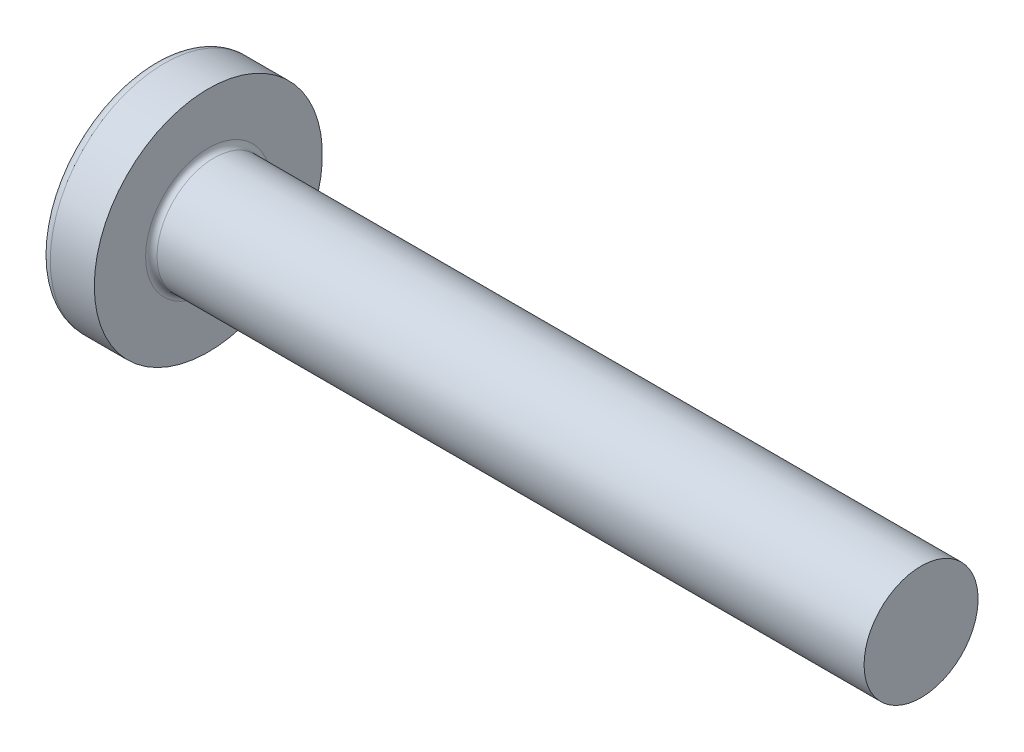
ISO-10303-21;
HEADER;
FILE_DESCRIPTION(('STEP AP214'),'2;1');
FILE_NAME('part.step','',(''),(''),'','','');
FILE_SCHEMA(('AUTOMOTIVE_DESIGN { 1 0 10303 214 1 1 1 1 }'));
ENDSEC;
DATA;
#1=APPLICATION_CONTEXT('core data for automotive mechanical design processes');
#2=APPLICATION_PROTOCOL_DEFINITION('international standard','automotive_design',2000,#1);
#3=PRODUCT_CONTEXT('',#1,'mechanical');
#4=PRODUCT('Part','Part','',(#3));
#5=PRODUCT_RELATED_PRODUCT_CATEGORY('part','',(#4));
#6=PRODUCT_DEFINITION_FORMATION('','',#4);
#7=PRODUCT_DEFINITION_CONTEXT('part definition',#1,'design');
#8=PRODUCT_DEFINITION('design','',#6,#7);
#9=PRODUCT_DEFINITION_SHAPE('','',#8);
#10=(LENGTH_UNIT() NAMED_UNIT(*) SI_UNIT(.MILLI.,.METRE.));
#11=(NAMED_UNIT(*) PLANE_ANGLE_UNIT() SI_UNIT($,.RADIAN.));
#12=(NAMED_UNIT(*) SI_UNIT($,.STERADIAN.) SOLID_ANGLE_UNIT());
#13=UNCERTAINTY_MEASURE_WITH_UNIT(LENGTH_MEASURE(1.E-05),#10,'distance_accuracy_value','');
#14=(GEOMETRIC_REPRESENTATION_CONTEXT(3) GLOBAL_UNCERTAINTY_ASSIGNED_CONTEXT((#13)) GLOBAL_UNIT_ASSIGNED_CONTEXT((#10,
#11,#12)) REPRESENTATION_CONTEXT('',''));
#15=CARTESIAN_POINT('',(0.,0.,0.));
#16=DIRECTION('',(0.,0.,1.));
#17=DIRECTION('',(1.,0.,0.));
#18=AXIS2_PLACEMENT_3D('',#15,#16,#17);
#19=CARTESIAN_POINT('',(6.5,0.,0.));
#20=DIRECTION('',(-1.,0.,0.));
#21=DIRECTION('',(0.,1.,0.));
#22=AXIS2_PLACEMENT_3D('',#19,#20,#21);
#23=SPHERICAL_SURFACE('',#22,6.5);
#24=CARTESIAN_POINT('',(1.26538895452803,0.,0.));
#25=DIRECTION('',(-1.,0.,0.));
#26=DIRECTION('',(0.,0.,1.));
#27=AXIS2_PLACEMENT_3D('',#24,#25,#26);
#28=CIRCLE('',#27,3.85342019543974);
#29=CARTESIAN_POINT('',(1.26538895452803,0.,3.85342019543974));
#30=VERTEX_POINT('',#29);
#31=EDGE_CURVE('E210',#30,#30,#28,.T.);
#32=ORIENTED_EDGE('',*,*,#31,.T.);
#33=EDGE_LOOP('',(#32));
#34=FACE_BOUND('',#33,.T.);
#35=CARTESIAN_POINT('',(0.0788099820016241,0.,0.));
#36=DIRECTION('',(1.,0.,0.));
#37=DIRECTION('',(0.,0.,-1.));
#38=AXIS2_PLACEMENT_3D('',#35,#36,#37);
#39=CIRCLE('',#38,1.0091178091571);
#40=CARTESIAN_POINT('',(0.0788099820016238,-0.514999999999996,-0.867809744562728));
#41=VERTEX_POINT('',#40);
#42=CARTESIAN_POINT('',(0.0788099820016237,-0.867809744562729,-0.515));
#43=VERTEX_POINT('',#42);
#44=EDGE_CURVE('E398',#41,#43,#39,.F.);
#45=ORIENTED_EDGE('',*,*,#44,.F.);
#46=CARTESIAN_POINT('',(6.5,-0.515,0.));
#47=DIRECTION('',(0.,1.,0.));
#48=DIRECTION('',(0.,0.,1.));
#49=AXIS2_PLACEMENT_3D('',#46,#47,#48);
#50=CIRCLE('',#49,6.47956595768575);
#51=CARTESIAN_POINT('',(0.331830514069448,-0.514999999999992,-1.98455541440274));
#52=VERTEX_POINT('',#51);
#53=EDGE_CURVE('E255',#52,#41,#50,.T.);
#54=ORIENTED_EDGE('',*,*,#53,.F.);
#55=CARTESIAN_POINT('',(6.06443205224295,0.,0.873614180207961));
#56=DIRECTION('',(0.446197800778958,0.,-0.89493436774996));
#57=DIRECTION('',(-0.89493436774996,0.,-0.446197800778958));
#58=AXIS2_PLACEMENT_3D('',#55,#56,#57);
#59=CIRCLE('',#58,6.4262803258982);
#60=CARTESIAN_POINT('',(0.331830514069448,0.515000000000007,-1.98455541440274));
#61=VERTEX_POINT('',#60);
#62=EDGE_CURVE('E229',#52,#61,#59,.T.);
#63=ORIENTED_EDGE('',*,*,#62,.T.);
#64=CARTESIAN_POINT('',(6.5,0.515,0.));
#65=DIRECTION('',(0.,-1.,0.));
#66=DIRECTION('',(0.,0.,-1.));
#67=AXIS2_PLACEMENT_3D('',#64,#65,#66);
#68=CIRCLE('',#67,6.47956595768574);
#69=CARTESIAN_POINT('',(0.0788099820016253,0.515000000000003,-0.867809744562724));
#70=VERTEX_POINT('',#69);
#71=EDGE_CURVE('E263',#70,#61,#68,.T.);
#72=ORIENTED_EDGE('',*,*,#71,.F.);
#73=CARTESIAN_POINT('',(0.0788099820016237,0.867809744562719,-0.515));
#74=VERTEX_POINT('',#73);
#75=EDGE_CURVE('E330',#74,#70,#39,.F.);
#76=ORIENTED_EDGE('',*,*,#75,.F.);
#77=CARTESIAN_POINT('',(6.5,0.,-0.515));
#78=DIRECTION('',(0.,0.,1.));
#79=DIRECTION('',(1.,0.,0.));
#80=AXIS2_PLACEMENT_3D('',#77,#78,#79);
#81=CIRCLE('',#80,6.47956595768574);
#82=CARTESIAN_POINT('',(0.331830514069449,1.98455541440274,-0.515));
#83=VERTEX_POINT('',#82);
#84=EDGE_CURVE('E223',#83,#74,#81,.T.);
#85=ORIENTED_EDGE('',*,*,#84,.F.);
#86=CARTESIAN_POINT('',(6.06443205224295,-0.873614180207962,0.));
#87=DIRECTION('',(0.446197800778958,0.89493436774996,0.));
#88=DIRECTION('',(-0.89493436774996,0.446197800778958,0.));
#89=AXIS2_PLACEMENT_3D('',#86,#87,#88);
#90=CIRCLE('',#89,6.4262803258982);
#91=CARTESIAN_POINT('',(0.331830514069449,1.98455541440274,0.514999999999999));
#92=VERTEX_POINT('',#91);
#93=EDGE_CURVE('E226',#83,#92,#90,.T.);
#94=ORIENTED_EDGE('',*,*,#93,.T.);
#95=CARTESIAN_POINT('',(6.5,0.,0.515));
#96=DIRECTION('',(0.,0.,-1.));
#97=DIRECTION('',(0.,1.,0.));
#98=AXIS2_PLACEMENT_3D('',#95,#96,#97);
#99=CIRCLE('',#98,6.47956595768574);
#100=CARTESIAN_POINT('',(0.0788099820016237,0.867809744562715,0.514999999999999));
#101=VERTEX_POINT('',#100);
#102=EDGE_CURVE('E219',#101,#92,#99,.T.);
#103=ORIENTED_EDGE('',*,*,#102,.F.);
#104=CARTESIAN_POINT('',(0.0788099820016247,0.514999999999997,0.867809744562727));
#105=VERTEX_POINT('',#104);
#106=EDGE_CURVE('E360',#105,#101,#39,.F.);
#107=ORIENTED_EDGE('',*,*,#106,.F.);
#108=CARTESIAN_POINT('',(0.331830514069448,0.514999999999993,1.98455541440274));
#109=VERTEX_POINT('',#108);
#110=EDGE_CURVE('E239',#109,#105,#68,.T.);
#111=ORIENTED_EDGE('',*,*,#110,.F.);
#112=CARTESIAN_POINT('',(6.06443205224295,0.,-0.873614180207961));
#113=DIRECTION('',(0.446197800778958,0.,0.89493436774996));
#114=DIRECTION('',(0.89493436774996,0.,-0.446197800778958));
#115=AXIS2_PLACEMENT_3D('',#112,#113,#114);
#116=CIRCLE('',#115,6.4262803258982);
#117=CARTESIAN_POINT('',(0.331830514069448,-0.515000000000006,1.98455541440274));
#118=VERTEX_POINT('',#117);
#119=EDGE_CURVE('E44',#109,#118,#116,.T.);
#120=ORIENTED_EDGE('',*,*,#119,.T.);
#121=CARTESIAN_POINT('',(0.0788099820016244,-0.515000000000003,0.867809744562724));
#122=VERTEX_POINT('',#121);
#123=EDGE_CURVE('E236',#122,#118,#50,.T.);
#124=ORIENTED_EDGE('',*,*,#123,.F.);
#125=CARTESIAN_POINT('',(0.0788099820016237,-0.867809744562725,0.514999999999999));
#126=VERTEX_POINT('',#125);
#127=EDGE_CURVE('E394',#126,#122,#39,.F.);
#128=ORIENTED_EDGE('',*,*,#127,.F.);
#129=CARTESIAN_POINT('',(0.331830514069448,-1.98455541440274,0.514999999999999));
#130=VERTEX_POINT('',#129);
#131=EDGE_CURVE('E220',#130,#126,#99,.T.);
#132=ORIENTED_EDGE('',*,*,#131,.F.);
#133=CARTESIAN_POINT('',(6.06443205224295,0.87361418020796,0.));
#134=DIRECTION('',(0.446197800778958,-0.89493436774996,0.));
#135=DIRECTION('',(0.89493436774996,0.446197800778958,0.));
#136=AXIS2_PLACEMENT_3D('',#133,#134,#135);
#137=CIRCLE('',#136,6.4262803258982);
#138=CARTESIAN_POINT('',(0.331830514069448,-1.98455541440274,-0.515));
#139=VERTEX_POINT('',#138);
#140=EDGE_CURVE('E216',#130,#139,#137,.T.);
#141=ORIENTED_EDGE('',*,*,#140,.T.);
#142=EDGE_CURVE('E59',#43,#139,#81,.T.);
#143=ORIENTED_EDGE('',*,*,#142,.F.);
#144=EDGE_LOOP('',(#45,#54,#63,#72,#76,#85,#94,#103,#107,#111,#120,#124,#128,#132,#141,#143));
#145=FACE_BOUND('',#144,.T.);
#146=ADVANCED_FACE('F31',(#34,#145),#23,.T.);
#147=CARTESIAN_POINT('',(0.,2.15,-0.515));
#148=DIRECTION('',(0.,0.,1.));
#149=DIRECTION('',(1.,0.,0.));
#150=AXIS2_PLACEMENT_3D('',#147,#148,#149);
#151=PLANE('',#150);
#152=ORIENTED_EDGE('',*,*,#84,.T.);
#153=CARTESIAN_POINT('',(-1.51195208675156,0.994972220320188,-0.515));
#154=CARTESIAN_POINT('',(-1.20405981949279,0.970722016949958,-0.515));
#155=CARTESIAN_POINT('',(-0.896180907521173,0.946299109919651,-0.515));
#156=CARTESIAN_POINT('',(-0.280449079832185,0.896981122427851,-0.515));
#157=CARTESIAN_POINT('',(0.0274038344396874,0.872086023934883,-0.515));
#158=CARTESIAN_POINT('',(0.489146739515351,0.83429553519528,-0.515));
#159=CARTESIAN_POINT('',(0.643055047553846,0.821624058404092,-0.515));
#160=CARTESIAN_POINT('',(0.950856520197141,0.796108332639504,-0.515));
#161=CARTESIAN_POINT('',(1.10474968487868,0.783264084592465,-0.515));
#162=CARTESIAN_POINT('',(1.41251352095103,0.757376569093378,-0.515));
#163=CARTESIAN_POINT('',(1.56638419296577,0.744333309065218,-0.515));
#164=CARTESIAN_POINT('',(1.87410847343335,0.718013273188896,-0.515));
#165=CARTESIAN_POINT('',(2.02796208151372,0.704736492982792,-0.515));
#166=CARTESIAN_POINT('',(2.36455311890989,0.675386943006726,-0.515));
#167=CARTESIAN_POINT('',(2.54728562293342,0.659257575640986,-0.515));
#168=CARTESIAN_POINT('',(2.91270624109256,0.626517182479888,-0.515));
#169=CARTESIAN_POINT('',(3.09539435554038,0.609906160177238,-0.515));
#170=CARTESIAN_POINT('',(3.46069832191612,0.576073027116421,-0.515));
#171=CARTESIAN_POINT('',(3.64331417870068,0.558850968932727,-0.515));
#172=CARTESIAN_POINT('',(4.00847437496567,0.523604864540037,-0.515));
#173=CARTESIAN_POINT('',(4.19101871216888,0.505580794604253,-0.515));
#174=CARTESIAN_POINT('',(4.55606208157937,0.468429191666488,-0.515));
#175=CARTESIAN_POINT('',(4.73856107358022,0.449301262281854,-0.515));
#176=CARTESIAN_POINT('',(5.10337547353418,0.409473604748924,-0.515));
#177=CARTESIAN_POINT('',(5.28569089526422,0.38877400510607,-0.515));
#178=CARTESIAN_POINT('',(5.55897278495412,0.355828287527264,-0.515));
#179=CARTESIAN_POINT('',(5.65005277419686,0.344527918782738,-0.515));
#180=CARTESIAN_POINT('',(5.83209904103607,0.321075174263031,-0.515));
#181=CARTESIAN_POINT('',(5.92306532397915,0.308922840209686,-0.515));
#182=CARTESIAN_POINT('',(6.10486078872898,0.28342733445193,-0.515));
#183=CARTESIAN_POINT('',(6.1956899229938,0.270083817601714,-0.515));
#184=CARTESIAN_POINT('',(6.33172773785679,0.248701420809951,-0.515));
#185=CARTESIAN_POINT('',(6.37704304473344,0.241345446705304,-0.515));
#186=CARTESIAN_POINT('',(6.4675722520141,0.226018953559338,-0.515));
#187=CARTESIAN_POINT('',(6.51278614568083,0.218048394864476,-0.515));
#188=CARTESIAN_POINT('',(6.55793125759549,0.209691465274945,-0.515));
#189=B_SPLINE_CURVE_WITH_KNOTS('',3,(#153,#154,#155,#156,#157,#158,#159,#160,#161,#162,#163,
#164,#165,#166,#167,#168,#169,#170,#171,#172,#173,#174,#175,#176,#177,#178,#179,#180,#181,#182,
#183,#184,#185,#186,#187,#188),.UNSPECIFIED.,.F.,.F.,(4,2,2,2,2,2,2,2,2,2,2,2,2,2,2,2,2,4),(0.,
0.926537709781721,1.85311087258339,2.31639796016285,2.77968256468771,3.24294992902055,
3.70622594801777,4.25655436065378,4.80687878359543,5.35715597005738,5.90744944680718,
6.45794177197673,7.008389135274,7.28372117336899,7.55903973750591,7.83443833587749,
7.97216007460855,8.10989070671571),.UNSPECIFIED.);
#190=CARTESIAN_POINT('',(2.34,0.677477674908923,-0.515));
#191=VERTEX_POINT('',#190);
#192=EDGE_CURVE('E323',#74,#191,#189,.T.);
#193=ORIENTED_EDGE('',*,*,#192,.T.);
#194=DIRECTION('',(0.,1.,0.));
#195=VECTOR('',#194,1.);
#196=CARTESIAN_POINT('',(2.34,-0.983319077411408,-0.515));
#197=LINE('',#196,#195);
#198=CARTESIAN_POINT('',(2.34,0.983319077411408,-0.515));
#199=VERTEX_POINT('',#198);
#200=EDGE_CURVE('E278',#191,#199,#197,.T.);
#201=ORIENTED_EDGE('',*,*,#200,.T.);
#202=DIRECTION('',(0.89493436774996,-0.446197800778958,0.));
#203=VECTOR('',#202,1.);
#204=CARTESIAN_POINT('',(0.,2.15,-0.515));
#205=LINE('',#204,#203);
#206=EDGE_CURVE('E284',#83,#199,#205,.T.);
#207=ORIENTED_EDGE('',*,*,#206,.F.);
#208=EDGE_LOOP('',(#152,#193,#201,#207));
#209=FACE_BOUND('',#208,.T.);
#210=ADVANCED_FACE('F165',(#209),#151,.T.);
#211=CARTESIAN_POINT('',(2.34,-0.983319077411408,-0.515));
#212=VERTEX_POINT('',#211);
#213=CARTESIAN_POINT('',(2.34,-0.677477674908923,-0.515));
#214=VERTEX_POINT('',#213);
#215=EDGE_CURVE('E275',#212,#214,#197,.T.);
#216=ORIENTED_EDGE('',*,*,#215,.T.);
#217=CARTESIAN_POINT('',(-1.51195208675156,-0.994972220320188,-0.515));
#218=CARTESIAN_POINT('',(-1.20405981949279,-0.970722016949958,-0.515));
#219=CARTESIAN_POINT('',(-0.896180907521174,-0.946299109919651,-0.515));
#220=CARTESIAN_POINT('',(-0.280449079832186,-0.896981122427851,-0.515));
#221=CARTESIAN_POINT('',(0.0274038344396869,-0.872086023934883,-0.515));
#222=CARTESIAN_POINT('',(0.48914673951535,-0.83429553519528,-0.515));
#223=CARTESIAN_POINT('',(0.643055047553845,-0.821624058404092,-0.515));
#224=CARTESIAN_POINT('',(0.95085652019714,-0.796108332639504,-0.515));
#225=CARTESIAN_POINT('',(1.10474968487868,-0.783264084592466,-0.515));
#226=CARTESIAN_POINT('',(1.41251352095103,-0.757376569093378,-0.515));
#227=CARTESIAN_POINT('',(1.56638419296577,-0.744333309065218,-0.515));
#228=CARTESIAN_POINT('',(1.87410847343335,-0.718013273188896,-0.515));
#229=CARTESIAN_POINT('',(2.02796208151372,-0.704736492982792,-0.515));
#230=CARTESIAN_POINT('',(2.36455311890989,-0.675386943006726,-0.515));
#231=CARTESIAN_POINT('',(2.54728562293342,-0.659257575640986,-0.515));
#232=CARTESIAN_POINT('',(2.91270624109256,-0.626517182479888,-0.515));
#233=CARTESIAN_POINT('',(3.09539435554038,-0.609906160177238,-0.515));
#234=CARTESIAN_POINT('',(3.46069832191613,-0.576073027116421,-0.515));
#235=CARTESIAN_POINT('',(3.64331417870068,-0.558850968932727,-0.515));
#236=CARTESIAN_POINT('',(4.00847437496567,-0.523604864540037,-0.515));
#237=CARTESIAN_POINT('',(4.19101871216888,-0.505580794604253,-0.515));
#238=CARTESIAN_POINT('',(4.55606208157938,-0.468429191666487,-0.515));
#239=CARTESIAN_POINT('',(4.73856107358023,-0.449301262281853,-0.515));
#240=CARTESIAN_POINT('',(5.10337547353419,-0.409473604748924,-0.515));
#241=CARTESIAN_POINT('',(5.28569089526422,-0.388774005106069,-0.515));
#242=CARTESIAN_POINT('',(5.55897278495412,-0.355828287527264,-0.515));
#243=CARTESIAN_POINT('',(5.65005277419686,-0.344527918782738,-0.515));
#244=CARTESIAN_POINT('',(5.83209904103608,-0.321075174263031,-0.515));
#245=CARTESIAN_POINT('',(5.92306532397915,-0.308922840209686,-0.515));
#246=CARTESIAN_POINT('',(6.10486078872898,-0.28342733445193,-0.515));
#247=CARTESIAN_POINT('',(6.1956899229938,-0.270083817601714,-0.515));
#248=CARTESIAN_POINT('',(6.33172773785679,-0.248701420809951,-0.515));
#249=CARTESIAN_POINT('',(6.37704304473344,-0.241345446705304,-0.515));
#250=CARTESIAN_POINT('',(6.4675722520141,-0.226018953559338,-0.515));
#251=CARTESIAN_POINT('',(6.51278614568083,-0.218048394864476,-0.515));
#252=CARTESIAN_POINT('',(6.55793125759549,-0.209691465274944,-0.515));
#253=B_SPLINE_CURVE_WITH_KNOTS('',3,(#217,#218,#219,#220,#221,#222,#223,#224,#225,#226,#227,
#228,#229,#230,#231,#232,#233,#234,#235,#236,#237,#238,#239,#240,#241,#242,#243,#244,#245,#246,
#247,#248,#249,#250,#251,#252),.UNSPECIFIED.,.F.,.F.,(4,2,2,2,2,2,2,2,2,2,2,2,2,2,2,2,2,4),(0.,
0.926537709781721,1.85311087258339,2.31639796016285,2.77968256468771,3.24294992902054,
3.70622594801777,4.25655436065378,4.80687878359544,5.35715597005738,5.90744944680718,
6.45794177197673,7.008389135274,7.28372117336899,7.55903973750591,7.83443833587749,
7.97216007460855,8.10989070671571),.UNSPECIFIED.);
#254=EDGE_CURVE('E316',#214,#43,#253,.F.);
#255=ORIENTED_EDGE('',*,*,#254,.T.);
#256=ORIENTED_EDGE('',*,*,#142,.T.);
#257=DIRECTION('',(0.89493436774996,0.446197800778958,0.));
#258=VECTOR('',#257,1.);
#259=CARTESIAN_POINT('',(0.,-2.15,-0.515));
#260=LINE('',#259,#258);
#261=EDGE_CURVE('E281',#139,#212,#260,.T.);
#262=ORIENTED_EDGE('',*,*,#261,.T.);
#263=EDGE_LOOP('',(#216,#255,#256,#262));
#264=FACE_BOUND('',#263,.T.);
#265=ADVANCED_FACE('F172',(#264),#151,.T.);
#266=CARTESIAN_POINT('',(0.,-2.15,0.514999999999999));
#267=DIRECTION('',(0.,0.,-1.));
#268=DIRECTION('',(0.,1.,0.));
#269=AXIS2_PLACEMENT_3D('',#266,#267,#268);
#270=PLANE('',#269);
#271=DIRECTION('',(0.,-1.,0.));
#272=VECTOR('',#271,1.);
#273=CARTESIAN_POINT('',(2.34,0.983319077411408,0.515));
#274=LINE('',#273,#272);
#275=CARTESIAN_POINT('',(2.34,0.983319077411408,0.515));
#276=VERTEX_POINT('',#275);
#277=CARTESIAN_POINT('',(2.34,0.677477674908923,0.515));
#278=VERTEX_POINT('',#277);
#279=EDGE_CURVE('E268',#276,#278,#274,.T.);
#280=ORIENTED_EDGE('',*,*,#279,.T.);
#281=CARTESIAN_POINT('',(-1.51195208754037,0.994972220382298,0.514999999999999));
#282=CARTESIAN_POINT('',(-1.20405982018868,0.970722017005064,0.514999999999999));
#283=CARTESIAN_POINT('',(-0.896180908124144,0.946299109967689,0.514999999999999));
#284=CARTESIAN_POINT('',(-0.280449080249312,0.896981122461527,0.515));
#285=CARTESIAN_POINT('',(0.0274038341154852,0.872086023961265,0.515));
#286=CARTESIAN_POINT('',(0.489146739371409,0.834295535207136,0.515));
#287=CARTESIAN_POINT('',(0.643055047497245,0.821624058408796,0.515));
#288=CARTESIAN_POINT('',(0.950856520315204,0.796108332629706,0.515));
#289=CARTESIAN_POINT('',(1.10474968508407,0.783264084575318,0.515));
#290=CARTESIAN_POINT('',(1.41251352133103,0.757376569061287,0.515));
#291=CARTESIAN_POINT('',(1.56638419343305,0.744333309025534,0.515));
#292=CARTESIAN_POINT('',(1.87410847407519,0.718013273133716,0.515));
#293=CARTESIAN_POINT('',(2.02796208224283,0.70473649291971,0.515));
#294=CARTESIAN_POINT('',(2.36455311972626,0.675386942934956,0.515));
#295=CARTESIAN_POINT('',(2.5472856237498,0.659257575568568,0.515));
#296=CARTESIAN_POINT('',(2.91270624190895,0.626517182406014,0.515));
#297=CARTESIAN_POINT('',(3.09539435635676,0.609906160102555,0.515));
#298=CARTESIAN_POINT('',(3.46069832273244,0.576073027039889,0.515));
#299=CARTESIAN_POINT('',(3.64331417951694,0.558850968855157,0.515));
#300=CARTESIAN_POINT('',(4.00847437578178,0.523604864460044,0.515));
#301=CARTESIAN_POINT('',(4.1910187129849,0.505580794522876,0.515));
#302=CARTESIAN_POINT('',(4.55606208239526,0.46842919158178,0.515));
#303=CARTESIAN_POINT('',(4.73856107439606,0.449301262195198,0.515));
#304=CARTESIAN_POINT('',(5.10337547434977,0.409473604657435,0.515));
#305=CARTESIAN_POINT('',(5.28569089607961,0.388774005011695,0.515));
#306=CARTESIAN_POINT('',(5.55897278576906,0.355828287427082,0.515));
#307=CARTESIAN_POINT('',(5.65005277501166,0.344527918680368,0.515));
#308=CARTESIAN_POINT('',(5.83209904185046,0.321075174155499,0.515));
#309=CARTESIAN_POINT('',(5.92306532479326,0.30892284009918,0.515));
#310=CARTESIAN_POINT('',(6.10486078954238,0.283427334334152,0.515));
#311=CARTESIAN_POINT('',(6.19568992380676,0.270083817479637,0.515));
#312=CARTESIAN_POINT('',(6.33172773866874,0.248701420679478,0.515));
#313=CARTESIAN_POINT('',(6.377043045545,0.241345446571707,0.515));
#314=CARTESIAN_POINT('',(6.46757225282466,0.226018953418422,0.515));
#315=CARTESIAN_POINT('',(6.51278614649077,0.218048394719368,0.515));
#316=CARTESIAN_POINT('',(6.55793125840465,0.209691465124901,0.515));
#317=B_SPLINE_CURVE_WITH_KNOTS('',3,(#281,#282,#283,#284,#285,#286,#287,#288,#289,#290,#291,
#292,#293,#294,#295,#296,#297,#298,#299,#300,#301,#302,#303,#304,#305,#306,#307,#308,#309,#310,
#311,#312,#313,#314,#315,#316),.UNSPECIFIED.,.F.,.F.,(4,2,2,2,2,2,2,2,2,2,2,2,2,2,2,2,2,4),(0.,
0.926537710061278,1.85311087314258,2.31639796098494,2.77968256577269,3.24294993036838,
3.70622594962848,4.25655436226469,4.80687878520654,5.3571559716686,5.90744944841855,
6.45794177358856,7.00838913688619,7.28372117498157,7.55903973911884,7.83443833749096,
7.97216007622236,8.10989070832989),.UNSPECIFIED.);
#318=EDGE_CURVE('E361',#278,#101,#317,.F.);
#319=ORIENTED_EDGE('',*,*,#318,.T.);
#320=ORIENTED_EDGE('',*,*,#102,.T.);
#321=DIRECTION('',(0.89493436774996,-0.446197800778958,0.));
#322=VECTOR('',#321,1.);
#323=CARTESIAN_POINT('',(0.,2.15,0.515));
#324=LINE('',#323,#322);
#325=EDGE_CURVE('E283',#92,#276,#324,.T.);
#326=ORIENTED_EDGE('',*,*,#325,.T.);
#327=EDGE_LOOP('',(#280,#319,#320,#326));
#328=FACE_BOUND('',#327,.T.);
#329=ADVANCED_FACE('F311',(#328),#270,.T.);
#330=ORIENTED_EDGE('',*,*,#131,.T.);
#331=CARTESIAN_POINT('',(-1.51195208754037,-0.994972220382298,0.514999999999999));
#332=CARTESIAN_POINT('',(-1.20405982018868,-0.970722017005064,0.514999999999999));
#333=CARTESIAN_POINT('',(-0.896180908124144,-0.946299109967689,0.514999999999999));
#334=CARTESIAN_POINT('',(-0.280449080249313,-0.896981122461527,0.514999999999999));
#335=CARTESIAN_POINT('',(0.0274038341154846,-0.872086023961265,0.514999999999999));
#336=CARTESIAN_POINT('',(0.489146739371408,-0.834295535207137,0.514999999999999));
#337=CARTESIAN_POINT('',(0.643055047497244,-0.821624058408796,0.514999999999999));
#338=CARTESIAN_POINT('',(0.950856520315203,-0.796108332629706,0.514999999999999));
#339=CARTESIAN_POINT('',(1.10474968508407,-0.783264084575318,0.514999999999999));
#340=CARTESIAN_POINT('',(1.41251352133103,-0.757376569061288,0.514999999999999));
#341=CARTESIAN_POINT('',(1.56638419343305,-0.744333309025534,0.515));
#342=CARTESIAN_POINT('',(1.87410847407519,-0.718013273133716,0.515));
#343=CARTESIAN_POINT('',(2.02796208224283,-0.70473649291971,0.515));
#344=CARTESIAN_POINT('',(2.36455311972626,-0.675386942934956,0.515));
#345=CARTESIAN_POINT('',(2.5472856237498,-0.659257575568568,0.515));
#346=CARTESIAN_POINT('',(2.91270624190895,-0.626517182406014,0.515));
#347=CARTESIAN_POINT('',(3.09539435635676,-0.609906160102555,0.515));
#348=CARTESIAN_POINT('',(3.46069832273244,-0.576073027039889,0.515));
#349=CARTESIAN_POINT('',(3.64331417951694,-0.558850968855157,0.515));
#350=CARTESIAN_POINT('',(4.00847437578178,-0.523604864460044,0.515));
#351=CARTESIAN_POINT('',(4.1910187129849,-0.505580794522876,0.515));
#352=CARTESIAN_POINT('',(4.55606208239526,-0.46842919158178,0.515));
#353=CARTESIAN_POINT('',(4.73856107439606,-0.449301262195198,0.515));
#354=CARTESIAN_POINT('',(5.10337547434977,-0.409473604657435,0.515));
#355=CARTESIAN_POINT('',(5.28569089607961,-0.388774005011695,0.515));
#356=CARTESIAN_POINT('',(5.55897278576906,-0.355828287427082,0.515));
#357=CARTESIAN_POINT('',(5.65005277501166,-0.344527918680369,0.515));
#358=CARTESIAN_POINT('',(5.83209904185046,-0.3210751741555,0.515));
#359=CARTESIAN_POINT('',(5.92306532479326,-0.308922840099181,0.515));
#360=CARTESIAN_POINT('',(6.10486078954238,-0.283427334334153,0.515));
#361=CARTESIAN_POINT('',(6.19568992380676,-0.270083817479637,0.515));
#362=CARTESIAN_POINT('',(6.33172773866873,-0.248701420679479,0.515));
#363=CARTESIAN_POINT('',(6.37704304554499,-0.241345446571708,0.515));
#364=CARTESIAN_POINT('',(6.46757225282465,-0.226018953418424,0.515));
#365=CARTESIAN_POINT('',(6.51278614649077,-0.218048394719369,0.515));
#366=CARTESIAN_POINT('',(6.55793125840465,-0.209691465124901,0.515));
#367=B_SPLINE_CURVE_WITH_KNOTS('',3,(#331,#332,#333,#334,#335,#336,#337,#338,#339,#340,#341,
#342,#343,#344,#345,#346,#347,#348,#349,#350,#351,#352,#353,#354,#355,#356,#357,#358,#359,#360,
#361,#362,#363,#364,#365,#366),.UNSPECIFIED.,.F.,.F.,(4,2,2,2,2,2,2,2,2,2,2,2,2,2,2,2,2,4),(0.,
0.926537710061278,1.85311087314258,2.31639796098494,2.77968256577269,3.24294993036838,
3.70622594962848,4.25655436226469,4.80687878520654,5.3571559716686,5.90744944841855,
6.45794177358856,7.00838913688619,7.28372117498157,7.55903973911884,7.83443833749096,
7.97216007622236,8.10989070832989),.UNSPECIFIED.);
#368=CARTESIAN_POINT('',(2.34,-0.677477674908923,0.515));
#369=VERTEX_POINT('',#368);
#370=EDGE_CURVE('E351',#126,#369,#367,.T.);
#371=ORIENTED_EDGE('',*,*,#370,.T.);
#372=CARTESIAN_POINT('',(2.34,-0.983319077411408,0.515));
#373=VERTEX_POINT('',#372);
#374=EDGE_CURVE('E271',#369,#373,#274,.T.);
#375=ORIENTED_EDGE('',*,*,#374,.T.);
#376=DIRECTION('',(0.89493436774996,0.446197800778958,0.));
#377=VECTOR('',#376,1.);
#378=CARTESIAN_POINT('',(0.,-2.15,0.514999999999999));
#379=LINE('',#378,#377);
#380=EDGE_CURVE('E267',#130,#373,#379,.T.);
#381=ORIENTED_EDGE('',*,*,#380,.F.);
#382=EDGE_LOOP('',(#330,#371,#375,#381));
#383=FACE_BOUND('',#382,.T.);
#384=ADVANCED_FACE('F379',(#383),#270,.T.);
#385=CARTESIAN_POINT('',(2.34,0.983319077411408,-0.515));
#386=DIRECTION('',(-1.,0.,0.));
#387=DIRECTION('',(0.,0.,1.));
#388=AXIS2_PLACEMENT_3D('',#385,#386,#387);
#389=PLANE('',#388);
#390=ORIENTED_EDGE('',*,*,#374,.F.);
#391=CARTESIAN_POINT('',(2.34,0.,0.));
#392=DIRECTION('',(-1.,0.,0.));
#393=DIRECTION('',(0.,0.,1.));
#394=AXIS2_PLACEMENT_3D('',#391,#392,#393);
#395=CIRCLE('',#394,0.851);
#396=EDGE_CURVE('E393',#214,#369,#395,.T.);
#397=ORIENTED_EDGE('',*,*,#396,.F.);
#398=ORIENTED_EDGE('',*,*,#215,.F.);
#399=DIRECTION('',(0.,0.,1.));
#400=VECTOR('',#399,1.);
#401=CARTESIAN_POINT('',(2.34,-0.983319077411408,-0.515));
#402=LINE('',#401,#400);
#403=EDGE_CURVE('E264',#212,#373,#402,.T.);
#404=ORIENTED_EDGE('',*,*,#403,.T.);
#405=EDGE_LOOP('',(#390,#397,#398,#404));
#406=FACE_BOUND('',#405,.T.);
#407=ADVANCED_FACE('F376',(#406),#389,.T.);
#408=DIRECTION('',(0.,0.,-1.));
#409=VECTOR('',#408,1.);
#410=CARTESIAN_POINT('',(2.34,-0.515000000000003,0.983319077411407));
#411=LINE('',#410,#409);
#412=CARTESIAN_POINT('',(2.34,-0.514999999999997,-0.677477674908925));
#413=VERTEX_POINT('',#412);
#414=CARTESIAN_POINT('',(2.34,-0.514999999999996,-0.98331907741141));
#415=VERTEX_POINT('',#414);
#416=EDGE_CURVE('E420',#413,#415,#411,.T.);
#417=ORIENTED_EDGE('',*,*,#416,.F.);
#418=CARTESIAN_POINT('',(2.34,0.515000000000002,-0.677477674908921));
#419=VERTEX_POINT('',#418);
#420=EDGE_CURVE('E51',#419,#413,#395,.T.);
#421=ORIENTED_EDGE('',*,*,#420,.F.);
#422=DIRECTION('',(0.,0.,1.));
#423=VECTOR('',#422,1.);
#424=CARTESIAN_POINT('',(2.34,0.515000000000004,-0.983319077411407));
#425=LINE('',#424,#423);
#426=CARTESIAN_POINT('',(2.34,0.515000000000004,-0.983319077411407));
#427=VERTEX_POINT('',#426);
#428=EDGE_CURVE('E419',#427,#419,#425,.T.);
#429=ORIENTED_EDGE('',*,*,#428,.F.);
#430=DIRECTION('',(0.,-1.,0.));
#431=VECTOR('',#430,1.);
#432=CARTESIAN_POINT('',(2.34,0.515000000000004,-0.983319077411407));
#433=LINE('',#432,#431);
#434=EDGE_CURVE('E432',#427,#415,#433,.T.);
#435=ORIENTED_EDGE('',*,*,#434,.T.);
#436=EDGE_LOOP('',(#417,#421,#429,#435));
#437=FACE_BOUND('',#436,.T.);
#438=ADVANCED_FACE('F378',(#437),#389,.T.);
#439=ORIENTED_EDGE('',*,*,#200,.F.);
#440=EDGE_CURVE('E403',#278,#191,#395,.T.);
#441=ORIENTED_EDGE('',*,*,#440,.F.);
#442=ORIENTED_EDGE('',*,*,#279,.F.);
#443=DIRECTION('',(0.,0.,-1.));
#444=VECTOR('',#443,1.);
#445=CARTESIAN_POINT('',(2.34,0.983319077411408,0.515));
#446=LINE('',#445,#444);
#447=EDGE_CURVE('E272',#276,#199,#446,.T.);
#448=ORIENTED_EDGE('',*,*,#447,.T.);
#449=EDGE_LOOP('',(#439,#441,#442,#448));
#450=FACE_BOUND('',#449,.T.);
#451=ADVANCED_FACE('F453',(#450),#389,.T.);
#452=CARTESIAN_POINT('',(2.34,0.514999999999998,0.677477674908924));
#453=VERTEX_POINT('',#452);
#454=CARTESIAN_POINT('',(2.34,0.514999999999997,0.98331907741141));
#455=VERTEX_POINT('',#454);
#456=EDGE_CURVE('E253',#453,#455,#425,.T.);
#457=ORIENTED_EDGE('',*,*,#456,.F.);
#458=CARTESIAN_POINT('',(2.34,-0.515000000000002,0.677477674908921));
#459=VERTEX_POINT('',#458);
#460=EDGE_CURVE('E404',#459,#453,#395,.T.);
#461=ORIENTED_EDGE('',*,*,#460,.F.);
#462=CARTESIAN_POINT('',(2.34,-0.515000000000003,0.983319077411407));
#463=VERTEX_POINT('',#462);
#464=EDGE_CURVE('E435',#463,#459,#411,.T.);
#465=ORIENTED_EDGE('',*,*,#464,.F.);
#466=DIRECTION('',(0.,1.,0.));
#467=VECTOR('',#466,1.);
#468=CARTESIAN_POINT('',(2.34,-0.515000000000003,0.983319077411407));
#469=LINE('',#468,#467);
#470=EDGE_CURVE('E426',#463,#455,#469,.T.);
#471=ORIENTED_EDGE('',*,*,#470,.T.);
#472=EDGE_LOOP('',(#457,#461,#465,#471));
#473=FACE_BOUND('',#472,.T.);
#474=ADVANCED_FACE('F370',(#473),#389,.T.);
#475=CARTESIAN_POINT('',(0.,0.514999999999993,2.15));
#476=DIRECTION('',(0.,-1.,0.));
#477=DIRECTION('',(1.,0.,0.));
#478=AXIS2_PLACEMENT_3D('',#475,#476,#477);
#479=PLANE('',#478);
#480=ORIENTED_EDGE('',*,*,#110,.T.);
#481=CARTESIAN_POINT('',(-1.51195208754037,0.514999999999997,0.994972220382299));
#482=CARTESIAN_POINT('',(-1.20405982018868,0.514999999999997,0.970722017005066));
#483=CARTESIAN_POINT('',(-0.896180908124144,0.514999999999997,0.94629910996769));
#484=CARTESIAN_POINT('',(-0.280449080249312,0.514999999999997,0.896981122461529));
#485=CARTESIAN_POINT('',(0.0274038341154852,0.514999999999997,0.872086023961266));
#486=CARTESIAN_POINT('',(0.489146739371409,0.514999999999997,0.834295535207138));
#487=CARTESIAN_POINT('',(0.643055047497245,0.514999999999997,0.821624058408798));
#488=CARTESIAN_POINT('',(0.950856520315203,0.514999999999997,0.796108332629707));
#489=CARTESIAN_POINT('',(1.10474968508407,0.514999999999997,0.783264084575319));
#490=CARTESIAN_POINT('',(1.41251352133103,0.514999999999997,0.757376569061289));
#491=CARTESIAN_POINT('',(1.56638419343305,0.514999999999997,0.744333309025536));
#492=CARTESIAN_POINT('',(1.87410847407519,0.514999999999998,0.718013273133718));
#493=CARTESIAN_POINT('',(2.02796208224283,0.514999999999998,0.704736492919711));
#494=CARTESIAN_POINT('',(2.36455311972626,0.514999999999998,0.675386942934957));
#495=CARTESIAN_POINT('',(2.5472856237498,0.514999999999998,0.65925757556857));
#496=CARTESIAN_POINT('',(2.91270624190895,0.514999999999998,0.626517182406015));
#497=CARTESIAN_POINT('',(3.09539435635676,0.514999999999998,0.609906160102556));
#498=CARTESIAN_POINT('',(3.46069832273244,0.514999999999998,0.576073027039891));
#499=CARTESIAN_POINT('',(3.64331417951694,0.514999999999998,0.558850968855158));
#500=CARTESIAN_POINT('',(4.00847437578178,0.514999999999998,0.523604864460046));
#501=CARTESIAN_POINT('',(4.1910187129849,0.514999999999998,0.505580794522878));
#502=CARTESIAN_POINT('',(4.55606208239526,0.514999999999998,0.468429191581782));
#503=CARTESIAN_POINT('',(4.73856107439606,0.514999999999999,0.4493012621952));
#504=CARTESIAN_POINT('',(5.10337547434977,0.514999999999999,0.409473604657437));
#505=CARTESIAN_POINT('',(5.28569089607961,0.514999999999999,0.388774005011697));
#506=CARTESIAN_POINT('',(5.55897278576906,0.514999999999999,0.355828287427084));
#507=CARTESIAN_POINT('',(5.65005277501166,0.514999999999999,0.344527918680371));
#508=CARTESIAN_POINT('',(5.83209904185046,0.514999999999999,0.321075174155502));
#509=CARTESIAN_POINT('',(5.92306532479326,0.514999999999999,0.308922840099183));
#510=CARTESIAN_POINT('',(6.10486078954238,0.514999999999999,0.283427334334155));
#511=CARTESIAN_POINT('',(6.19568992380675,0.514999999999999,0.27008381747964));
#512=CARTESIAN_POINT('',(6.33172773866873,0.514999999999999,0.248701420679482));
#513=CARTESIAN_POINT('',(6.37704304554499,0.514999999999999,0.24134544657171));
#514=CARTESIAN_POINT('',(6.46757225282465,0.514999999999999,0.226018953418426));
#515=CARTESIAN_POINT('',(6.51278614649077,0.514999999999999,0.218048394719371));
#516=CARTESIAN_POINT('',(6.55793125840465,0.514999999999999,0.209691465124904));
#517=B_SPLINE_CURVE_WITH_KNOTS('',3,(#481,#482,#483,#484,#485,#486,#487,#488,#489,#490,#491,
#492,#493,#494,#495,#496,#497,#498,#499,#500,#501,#502,#503,#504,#505,#506,#507,#508,#509,#510,
#511,#512,#513,#514,#515,#516),.UNSPECIFIED.,.F.,.F.,(4,2,2,2,2,2,2,2,2,2,2,2,2,2,2,2,2,4),(0.,
0.926537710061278,1.85311087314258,2.31639796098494,2.77968256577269,3.24294993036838,
3.70622594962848,4.25655436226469,4.80687878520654,5.3571559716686,5.90744944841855,
6.45794177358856,7.00838913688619,7.28372117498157,7.55903973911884,7.83443833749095,
7.97216007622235,8.10989070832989),.UNSPECIFIED.);
#518=EDGE_CURVE('E356',#105,#453,#517,.T.);
#519=ORIENTED_EDGE('',*,*,#518,.T.);
#520=ORIENTED_EDGE('',*,*,#456,.T.);
#521=DIRECTION('',(0.89493436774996,0.,-0.446197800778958));
#522=VECTOR('',#521,1.);
#523=CARTESIAN_POINT('',(0.,0.514999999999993,2.15));
#524=LINE('',#523,#522);
#525=EDGE_CURVE('E246',#109,#455,#524,.T.);
#526=ORIENTED_EDGE('',*,*,#525,.F.);
#527=EDGE_LOOP('',(#480,#519,#520,#526));
#528=FACE_BOUND('',#527,.T.);
#529=ADVANCED_FACE('F250',(#528),#479,.T.);
#530=CARTESIAN_POINT('',(0.,-0.514999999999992,-2.15));
#531=DIRECTION('',(0.,1.,0.));
#532=DIRECTION('',(0.,0.,1.));
#533=AXIS2_PLACEMENT_3D('',#530,#531,#532);
#534=PLANE('',#533);
#535=ORIENTED_EDGE('',*,*,#464,.T.);
#536=CARTESIAN_POINT('',(-1.51195208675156,-0.515000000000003,0.994972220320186));
#537=CARTESIAN_POINT('',(-1.20405981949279,-0.515000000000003,0.970722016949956));
#538=CARTESIAN_POINT('',(-0.896180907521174,-0.515000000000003,0.946299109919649));
#539=CARTESIAN_POINT('',(-0.280449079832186,-0.515000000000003,0.89698112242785));
#540=CARTESIAN_POINT('',(0.0274038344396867,-0.515000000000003,0.872086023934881));
#541=CARTESIAN_POINT('',(0.48914673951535,-0.515000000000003,0.834295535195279));
#542=CARTESIAN_POINT('',(0.643055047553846,-0.515000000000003,0.821624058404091));
#543=CARTESIAN_POINT('',(0.95085652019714,-0.515000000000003,0.796108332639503));
#544=CARTESIAN_POINT('',(1.10474968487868,-0.515000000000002,0.783264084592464));
#545=CARTESIAN_POINT('',(1.41251352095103,-0.515000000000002,0.757376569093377));
#546=CARTESIAN_POINT('',(1.56638419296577,-0.515000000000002,0.744333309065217));
#547=CARTESIAN_POINT('',(1.87410847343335,-0.515000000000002,0.718013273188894));
#548=CARTESIAN_POINT('',(2.02796208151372,-0.515000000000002,0.70473649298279));
#549=CARTESIAN_POINT('',(2.36455311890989,-0.515000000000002,0.675386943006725));
#550=CARTESIAN_POINT('',(2.54728562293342,-0.515000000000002,0.659257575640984));
#551=CARTESIAN_POINT('',(2.91270624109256,-0.515000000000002,0.626517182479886));
#552=CARTESIAN_POINT('',(3.09539435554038,-0.515000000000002,0.609906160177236));
#553=CARTESIAN_POINT('',(3.46069832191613,-0.515000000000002,0.57607302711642));
#554=CARTESIAN_POINT('',(3.64331417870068,-0.515000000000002,0.558850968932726));
#555=CARTESIAN_POINT('',(4.00847437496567,-0.515000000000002,0.523604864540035));
#556=CARTESIAN_POINT('',(4.19101871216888,-0.515000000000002,0.505580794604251));
#557=CARTESIAN_POINT('',(4.55606208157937,-0.515000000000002,0.468429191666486));
#558=CARTESIAN_POINT('',(4.73856107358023,-0.515000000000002,0.449301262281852));
#559=CARTESIAN_POINT('',(5.10337547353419,-0.515000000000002,0.409473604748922));
#560=CARTESIAN_POINT('',(5.28569089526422,-0.515000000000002,0.388774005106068));
#561=CARTESIAN_POINT('',(5.55897278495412,-0.515000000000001,0.355828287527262));
#562=CARTESIAN_POINT('',(5.65005277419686,-0.515000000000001,0.344527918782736));
#563=CARTESIAN_POINT('',(5.83209904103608,-0.515000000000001,0.321075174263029));
#564=CARTESIAN_POINT('',(5.92306532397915,-0.515000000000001,0.308922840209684));
#565=CARTESIAN_POINT('',(6.10486078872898,-0.515000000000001,0.283427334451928));
#566=CARTESIAN_POINT('',(6.1956899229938,-0.515000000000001,0.270083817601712));
#567=CARTESIAN_POINT('',(6.33172773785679,-0.515000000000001,0.248701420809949));
#568=CARTESIAN_POINT('',(6.37704304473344,-0.515000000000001,0.241345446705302));
#569=CARTESIAN_POINT('',(6.4675722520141,-0.515000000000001,0.226018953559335));
#570=CARTESIAN_POINT('',(6.51278614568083,-0.515000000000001,0.218048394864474));
#571=CARTESIAN_POINT('',(6.55793125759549,-0.515000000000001,0.209691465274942));
#572=B_SPLINE_CURVE_WITH_KNOTS('',3,(#536,#537,#538,#539,#540,#541,#542,#543,#544,#545,#546,
#547,#548,#549,#550,#551,#552,#553,#554,#555,#556,#557,#558,#559,#560,#561,#562,#563,#564,#565,
#566,#567,#568,#569,#570,#571),.UNSPECIFIED.,.F.,.F.,(4,2,2,2,2,2,2,2,2,2,2,2,2,2,2,2,2,4),(0.,
0.926537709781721,1.85311087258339,2.31639796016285,2.77968256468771,3.24294992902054,
3.70622594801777,4.25655436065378,4.80687878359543,5.35715597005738,5.90744944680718,
6.45794177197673,7.008389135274,7.28372117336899,7.55903973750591,7.83443833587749,
7.97216007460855,8.10989070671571),.UNSPECIFIED.);
#573=EDGE_CURVE('E329',#459,#122,#572,.F.);
#574=ORIENTED_EDGE('',*,*,#573,.T.);
#575=ORIENTED_EDGE('',*,*,#123,.T.);
#576=DIRECTION('',(0.89493436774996,0.,-0.446197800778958));
#577=VECTOR('',#576,1.);
#578=CARTESIAN_POINT('',(0.,-0.515000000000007,2.15));
#579=LINE('',#578,#577);
#580=EDGE_CURVE('E248',#118,#463,#579,.T.);
#581=ORIENTED_EDGE('',*,*,#580,.T.);
#582=EDGE_LOOP('',(#535,#574,#575,#581));
#583=FACE_BOUND('',#582,.T.);
#584=ADVANCED_FACE('F369',(#583),#534,.T.);
#585=ORIENTED_EDGE('',*,*,#428,.T.);
#586=CARTESIAN_POINT('',(-1.51195208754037,0.515000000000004,-0.994972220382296));
#587=CARTESIAN_POINT('',(-1.20405982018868,0.515000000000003,-0.970722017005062));
#588=CARTESIAN_POINT('',(-0.896180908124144,0.515000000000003,-0.946299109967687));
#589=CARTESIAN_POINT('',(-0.280449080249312,0.515000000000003,-0.896981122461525));
#590=CARTESIAN_POINT('',(0.027403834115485,0.515000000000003,-0.872086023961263));
#591=CARTESIAN_POINT('',(0.489146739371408,0.515000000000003,-0.834295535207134));
#592=CARTESIAN_POINT('',(0.643055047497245,0.515000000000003,-0.821624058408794));
#593=CARTESIAN_POINT('',(0.950856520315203,0.515000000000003,-0.796108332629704));
#594=CARTESIAN_POINT('',(1.10474968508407,0.515000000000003,-0.783264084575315));
#595=CARTESIAN_POINT('',(1.41251352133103,0.515000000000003,-0.757376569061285));
#596=CARTESIAN_POINT('',(1.56638419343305,0.515000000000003,-0.744333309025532));
#597=CARTESIAN_POINT('',(1.87410847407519,0.515000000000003,-0.718013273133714));
#598=CARTESIAN_POINT('',(2.02796208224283,0.515000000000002,-0.704736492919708));
#599=CARTESIAN_POINT('',(2.36455311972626,0.515000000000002,-0.675386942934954));
#600=CARTESIAN_POINT('',(2.5472856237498,0.515000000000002,-0.659257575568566));
#601=CARTESIAN_POINT('',(2.91270624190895,0.515000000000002,-0.626517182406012));
#602=CARTESIAN_POINT('',(3.09539435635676,0.515000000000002,-0.609906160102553));
#603=CARTESIAN_POINT('',(3.46069832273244,0.515000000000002,-0.576073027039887));
#604=CARTESIAN_POINT('',(3.64331417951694,0.515000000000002,-0.558850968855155));
#605=CARTESIAN_POINT('',(4.00847437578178,0.515000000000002,-0.523604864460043));
#606=CARTESIAN_POINT('',(4.1910187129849,0.515000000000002,-0.505580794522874));
#607=CARTESIAN_POINT('',(4.55606208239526,0.515000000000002,-0.468429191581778));
#608=CARTESIAN_POINT('',(4.73856107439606,0.515000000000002,-0.449301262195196));
#609=CARTESIAN_POINT('',(5.10337547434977,0.515000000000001,-0.409473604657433));
#610=CARTESIAN_POINT('',(5.2856908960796,0.515000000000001,-0.388774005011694));
#611=CARTESIAN_POINT('',(5.55897278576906,0.515000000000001,-0.355828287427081));
#612=CARTESIAN_POINT('',(5.65005277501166,0.515000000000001,-0.344527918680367));
#613=CARTESIAN_POINT('',(5.83209904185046,0.515000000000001,-0.321075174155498));
#614=CARTESIAN_POINT('',(5.92306532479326,0.515000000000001,-0.308922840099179));
#615=CARTESIAN_POINT('',(6.10486078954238,0.515000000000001,-0.283427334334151));
#616=CARTESIAN_POINT('',(6.19568992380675,0.515000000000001,-0.270083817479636));
#617=CARTESIAN_POINT('',(6.33172773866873,0.515000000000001,-0.248701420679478));
#618=CARTESIAN_POINT('',(6.37704304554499,0.515000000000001,-0.241345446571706));
#619=CARTESIAN_POINT('',(6.46757225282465,0.515000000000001,-0.226018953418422));
#620=CARTESIAN_POINT('',(6.51278614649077,0.515000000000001,-0.218048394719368));
#621=CARTESIAN_POINT('',(6.55793125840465,0.515000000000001,-0.2096914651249));
#622=B_SPLINE_CURVE_WITH_KNOTS('',3,(#586,#587,#588,#589,#590,#591,#592,#593,#594,#595,#596,
#597,#598,#599,#600,#601,#602,#603,#604,#605,#606,#607,#608,#609,#610,#611,#612,#613,#614,#615,
#616,#617,#618,#619,#620,#621),.UNSPECIFIED.,.F.,.F.,(4,2,2,2,2,2,2,2,2,2,2,2,2,2,2,2,2,4),(0.,
0.926537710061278,1.85311087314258,2.31639796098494,2.77968256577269,3.24294993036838,
3.70622594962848,4.25655436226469,4.80687878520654,5.3571559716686,5.90744944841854,
6.45794177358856,7.00838913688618,7.28372117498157,7.55903973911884,7.83443833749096,
7.97216007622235,8.10989070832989),.UNSPECIFIED.);
#623=EDGE_CURVE('E331',#419,#70,#622,.F.);
#624=ORIENTED_EDGE('',*,*,#623,.T.);
#625=ORIENTED_EDGE('',*,*,#71,.T.);
#626=DIRECTION('',(0.89493436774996,0.,0.446197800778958));
#627=VECTOR('',#626,1.);
#628=CARTESIAN_POINT('',(0.,0.515000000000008,-2.15));
#629=LINE('',#628,#627);
#630=EDGE_CURVE('E257',#61,#427,#629,.T.);
#631=ORIENTED_EDGE('',*,*,#630,.T.);
#632=EDGE_LOOP('',(#585,#624,#625,#631));
#633=FACE_BOUND('',#632,.T.);
#634=ADVANCED_FACE('F371',(#633),#479,.T.);
#635=ORIENTED_EDGE('',*,*,#53,.T.);
#636=CARTESIAN_POINT('',(-1.51195208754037,-0.514999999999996,-0.9949722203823));
#637=CARTESIAN_POINT('',(-1.20405982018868,-0.514999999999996,-0.970722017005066));
#638=CARTESIAN_POINT('',(-0.896180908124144,-0.514999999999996,-0.946299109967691));
#639=CARTESIAN_POINT('',(-0.280449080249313,-0.514999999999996,-0.896981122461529));
#640=CARTESIAN_POINT('',(0.0274038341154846,-0.514999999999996,-0.872086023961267));
#641=CARTESIAN_POINT('',(0.489146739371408,-0.514999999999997,-0.834295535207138));
#642=CARTESIAN_POINT('',(0.643055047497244,-0.514999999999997,-0.821624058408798));
#643=CARTESIAN_POINT('',(0.950856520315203,-0.514999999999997,-0.796108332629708));
#644=CARTESIAN_POINT('',(1.10474968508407,-0.514999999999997,-0.783264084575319));
#645=CARTESIAN_POINT('',(1.41251352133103,-0.514999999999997,-0.757376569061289));
#646=CARTESIAN_POINT('',(1.56638419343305,-0.514999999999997,-0.744333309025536));
#647=CARTESIAN_POINT('',(1.87410847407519,-0.514999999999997,-0.718013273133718));
#648=CARTESIAN_POINT('',(2.02796208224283,-0.514999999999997,-0.704736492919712));
#649=CARTESIAN_POINT('',(2.36455311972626,-0.514999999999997,-0.675386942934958));
#650=CARTESIAN_POINT('',(2.5472856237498,-0.514999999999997,-0.65925757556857));
#651=CARTESIAN_POINT('',(2.91270624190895,-0.514999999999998,-0.626517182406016));
#652=CARTESIAN_POINT('',(3.09539435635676,-0.514999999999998,-0.609906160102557));
#653=CARTESIAN_POINT('',(3.46069832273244,-0.514999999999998,-0.576073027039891));
#654=CARTESIAN_POINT('',(3.64331417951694,-0.514999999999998,-0.558850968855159));
#655=CARTESIAN_POINT('',(4.00847437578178,-0.514999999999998,-0.523604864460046));
#656=CARTESIAN_POINT('',(4.1910187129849,-0.514999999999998,-0.505580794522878));
#657=CARTESIAN_POINT('',(4.55606208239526,-0.514999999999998,-0.468429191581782));
#658=CARTESIAN_POINT('',(4.73856107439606,-0.514999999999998,-0.4493012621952));
#659=CARTESIAN_POINT('',(5.10337547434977,-0.514999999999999,-0.409473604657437));
#660=CARTESIAN_POINT('',(5.28569089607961,-0.514999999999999,-0.388774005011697));
#661=CARTESIAN_POINT('',(5.55897278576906,-0.514999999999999,-0.355828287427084));
#662=CARTESIAN_POINT('',(5.65005277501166,-0.514999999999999,-0.344527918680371));
#663=CARTESIAN_POINT('',(5.83209904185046,-0.514999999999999,-0.321075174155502));
#664=CARTESIAN_POINT('',(5.92306532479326,-0.514999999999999,-0.308922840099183));
#665=CARTESIAN_POINT('',(6.10486078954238,-0.514999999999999,-0.283427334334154));
#666=CARTESIAN_POINT('',(6.19568992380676,-0.514999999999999,-0.270083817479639));
#667=CARTESIAN_POINT('',(6.33172773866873,-0.514999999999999,-0.248701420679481));
#668=CARTESIAN_POINT('',(6.37704304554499,-0.514999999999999,-0.241345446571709));
#669=CARTESIAN_POINT('',(6.46757225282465,-0.514999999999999,-0.226018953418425));
#670=CARTESIAN_POINT('',(6.51278614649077,-0.514999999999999,-0.218048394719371));
#671=CARTESIAN_POINT('',(6.55793125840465,-0.514999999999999,-0.209691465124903));
#672=B_SPLINE_CURVE_WITH_KNOTS('',3,(#636,#637,#638,#639,#640,#641,#642,#643,#644,#645,#646,
#647,#648,#649,#650,#651,#652,#653,#654,#655,#656,#657,#658,#659,#660,#661,#662,#663,#664,#665,
#666,#667,#668,#669,#670,#671),.UNSPECIFIED.,.F.,.F.,(4,2,2,2,2,2,2,2,2,2,2,2,2,2,2,2,2,4),(0.,
0.926537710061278,1.85311087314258,2.31639796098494,2.77968256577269,3.24294993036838,
3.70622594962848,4.25655436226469,4.80687878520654,5.3571559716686,5.90744944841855,
6.45794177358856,7.00838913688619,7.28372117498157,7.55903973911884,7.83443833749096,
7.97216007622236,8.10989070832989),.UNSPECIFIED.);
#673=EDGE_CURVE('E11',#41,#413,#672,.T.);
#674=ORIENTED_EDGE('',*,*,#673,.T.);
#675=ORIENTED_EDGE('',*,*,#416,.T.);
#676=DIRECTION('',(0.89493436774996,0.,0.446197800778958));
#677=VECTOR('',#676,1.);
#678=CARTESIAN_POINT('',(0.,-0.514999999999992,-2.15));
#679=LINE('',#678,#677);
#680=EDGE_CURVE('E430',#52,#415,#679,.T.);
#681=ORIENTED_EDGE('',*,*,#680,.F.);
#682=EDGE_LOOP('',(#635,#674,#675,#681));
#683=FACE_BOUND('',#682,.T.);
#684=ADVANCED_FACE('F196',(#683),#534,.T.);
#685=CARTESIAN_POINT('',(-25.4,0.,0.));
#686=DIRECTION('',(-1.,0.,0.));
#687=DIRECTION('',(0.,0.,1.));
#688=AXIS2_PLACEMENT_3D('',#685,#686,#687);
#689=CYLINDRICAL_SURFACE('',#688,2.);
#690=CARTESIAN_POINT('',(3.3,0.,0.));
#691=DIRECTION('',(-1.,0.,0.));
#692=DIRECTION('',(0.,0.,1.));
#693=AXIS2_PLACEMENT_3D('',#690,#691,#692);
#694=CIRCLE('',#693,2.);
#695=CARTESIAN_POINT('',(3.3,0.,2.));
#696=VERTEX_POINT('',#695);
#697=EDGE_CURVE('E207',#696,#696,#694,.F.);
#698=ORIENTED_EDGE('',*,*,#697,.T.);
#699=EDGE_LOOP('',(#698));
#700=FACE_BOUND('',#699,.T.);
#701=CARTESIAN_POINT('',(28.1,0.,0.));
#702=DIRECTION('',(-1.,0.,0.));
#703=DIRECTION('',(0.,0.,1.));
#704=AXIS2_PLACEMENT_3D('',#701,#702,#703);
#705=CIRCLE('',#704,2.);
#706=CARTESIAN_POINT('',(28.1,0.,2.));
#707=VERTEX_POINT('',#706);
#708=EDGE_CURVE('E287',#707,#707,#705,.T.);
#709=ORIENTED_EDGE('',*,*,#708,.T.);
#710=EDGE_LOOP('',(#709));
#711=FACE_BOUND('',#710,.T.);
#712=ADVANCED_FACE('F33',(#700,#711),#689,.T.);
#713=CARTESIAN_POINT('',(3.1,2.,0.));
#714=DIRECTION('',(-1.,0.,0.));
#715=DIRECTION('',(0.,0.,1.));
#716=AXIS2_PLACEMENT_3D('',#713,#714,#715);
#717=PLANE('',#716);
#718=CARTESIAN_POINT('',(3.1,0.,0.));
#719=DIRECTION('',(-1.,0.,0.));
#720=DIRECTION('',(0.,0.,1.));
#721=AXIS2_PLACEMENT_3D('',#718,#719,#720);
#722=CIRCLE('',#721,2.2);
#723=CARTESIAN_POINT('',(3.1,0.,2.2));
#724=VERTEX_POINT('',#723);
#725=EDGE_CURVE('E201',#724,#724,#722,.T.);
#726=ORIENTED_EDGE('',*,*,#725,.T.);
#727=EDGE_LOOP('',(#726));
#728=FACE_BOUND('',#727,.T.);
#729=CARTESIAN_POINT('',(3.1,0.,0.));
#730=DIRECTION('',(-1.,0.,0.));
#731=DIRECTION('',(0.,0.,1.));
#732=AXIS2_PLACEMENT_3D('',#729,#730,#731);
#733=CIRCLE('',#732,4.);
#734=CARTESIAN_POINT('',(3.1,0.,4.));
#735=VERTEX_POINT('',#734);
#736=EDGE_CURVE('E204',#735,#735,#733,.T.);
#737=ORIENTED_EDGE('',*,*,#736,.F.);
#738=EDGE_LOOP('',(#737));
#739=FACE_BOUND('',#738,.T.);
#740=ADVANCED_FACE('F187',(#728,#739),#717,.F.);
#741=CARTESIAN_POINT('',(-25.4,0.,0.));
#742=DIRECTION('',(-1.,0.,0.));
#743=DIRECTION('',(0.,0.,1.));
#744=AXIS2_PLACEMENT_3D('',#741,#742,#743);
#745=CYLINDRICAL_SURFACE('',#744,4.);
#746=ORIENTED_EDGE('',*,*,#736,.T.);
#747=EDGE_LOOP('',(#746));
#748=FACE_BOUND('',#747,.T.);
#749=CARTESIAN_POINT('',(1.55530587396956,0.,0.));
#750=DIRECTION('',(-1.,0.,0.));
#751=DIRECTION('',(0.,0.,1.));
#752=AXIS2_PLACEMENT_3D('',#749,#750,#751);
#753=CIRCLE('',#752,4.);
#754=CARTESIAN_POINT('',(1.55530587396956,0.,4.));
#755=VERTEX_POINT('',#754);
#756=EDGE_CURVE('E205',#755,#755,#753,.T.);
#757=ORIENTED_EDGE('',*,*,#756,.F.);
#758=EDGE_LOOP('',(#757));
#759=FACE_BOUND('',#758,.T.);
#760=ADVANCED_FACE('F184',(#748,#759),#745,.T.);
#761=CARTESIAN_POINT('',(1.55530587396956,0.,0.));
#762=DIRECTION('',(-1.,0.,0.));
#763=DIRECTION('',(0.,0.,1.));
#764=AXIS2_PLACEMENT_3D('',#761,#762,#763);
#765=TOROIDAL_SURFACE('',#764,3.64,0.36);
#766=ORIENTED_EDGE('',*,*,#756,.T.);
#767=EDGE_LOOP('',(#766));
#768=FACE_BOUND('',#767,.T.);
#769=ORIENTED_EDGE('',*,*,#31,.F.);
#770=EDGE_LOOP('',(#769));
#771=FACE_BOUND('',#770,.T.);
#772=ADVANCED_FACE('F181',(#768,#771),#765,.T.);
#773=CARTESIAN_POINT('',(28.1,2.,0.));
#774=DIRECTION('',(1.,0.,0.));
#775=DIRECTION('',(0.,0.,-1.));
#776=AXIS2_PLACEMENT_3D('',#773,#774,#775);
#777=PLANE('',#776);
#778=ORIENTED_EDGE('',*,*,#708,.F.);
#779=EDGE_LOOP('',(#778));
#780=FACE_BOUND('',#779,.T.);
#781=ADVANCED_FACE('F179',(#780),#777,.T.);
#782=CARTESIAN_POINT('',(3.3,0.,0.));
#783=DIRECTION('',(-1.,0.,0.));
#784=DIRECTION('',(0.,0.,1.));
#785=AXIS2_PLACEMENT_3D('',#782,#783,#784);
#786=TOROIDAL_SURFACE('',#785,2.2,0.2);
#787=ORIENTED_EDGE('',*,*,#697,.F.);
#788=EDGE_LOOP('',(#787));
#789=FACE_BOUND('',#788,.T.);
#790=ORIENTED_EDGE('',*,*,#725,.F.);
#791=EDGE_LOOP('',(#790));
#792=FACE_BOUND('',#791,.T.);
#793=ADVANCED_FACE('F296',(#789,#792),#786,.F.);
#794=CARTESIAN_POINT('',(2.34,0.983319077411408,0.515));
#795=DIRECTION('',(0.446197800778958,0.89493436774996,0.));
#796=DIRECTION('',(-0.89493436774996,0.446197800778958,0.));
#797=AXIS2_PLACEMENT_3D('',#794,#795,#796);
#798=PLANE('',#797);
#799=ORIENTED_EDGE('',*,*,#206,.T.);
#800=ORIENTED_EDGE('',*,*,#447,.F.);
#801=ORIENTED_EDGE('',*,*,#325,.F.);
#802=ORIENTED_EDGE('',*,*,#93,.F.);
#803=EDGE_LOOP('',(#799,#800,#801,#802));
#804=FACE_BOUND('',#803,.T.);
#805=ADVANCED_FACE('F299',(#804),#798,.F.);
#806=CARTESIAN_POINT('',(2.34,-0.983319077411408,-0.515));
#807=DIRECTION('',(0.446197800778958,-0.89493436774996,0.));
#808=DIRECTION('',(0.89493436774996,0.446197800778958,0.));
#809=AXIS2_PLACEMENT_3D('',#806,#807,#808);
#810=PLANE('',#809);
#811=ORIENTED_EDGE('',*,*,#380,.T.);
#812=ORIENTED_EDGE('',*,*,#403,.F.);
#813=ORIENTED_EDGE('',*,*,#261,.F.);
#814=ORIENTED_EDGE('',*,*,#140,.F.);
#815=EDGE_LOOP('',(#811,#812,#813,#814));
#816=FACE_BOUND('',#815,.T.);
#817=ADVANCED_FACE('F304',(#816),#810,.F.);
#818=CARTESIAN_POINT('',(2.34,-0.515000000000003,0.983319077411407));
#819=DIRECTION('',(0.446197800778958,0.,0.89493436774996));
#820=DIRECTION('',(-0.89493436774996,0.,0.446197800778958));
#821=AXIS2_PLACEMENT_3D('',#818,#819,#820);
#822=PLANE('',#821);
#823=ORIENTED_EDGE('',*,*,#525,.T.);
#824=ORIENTED_EDGE('',*,*,#470,.F.);
#825=ORIENTED_EDGE('',*,*,#580,.F.);
#826=ORIENTED_EDGE('',*,*,#119,.F.);
#827=EDGE_LOOP('',(#823,#824,#825,#826));
#828=FACE_BOUND('',#827,.T.);
#829=ADVANCED_FACE('F244',(#828),#822,.F.);
#830=CARTESIAN_POINT('',(2.34,0.515000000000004,-0.983319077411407));
#831=DIRECTION('',(0.446197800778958,0.,-0.89493436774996));
#832=DIRECTION('',(0.89493436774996,0.,0.446197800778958));
#833=AXIS2_PLACEMENT_3D('',#830,#831,#832);
#834=PLANE('',#833);
#835=ORIENTED_EDGE('',*,*,#680,.T.);
#836=ORIENTED_EDGE('',*,*,#434,.F.);
#837=ORIENTED_EDGE('',*,*,#630,.F.);
#838=ORIENTED_EDGE('',*,*,#62,.F.);
#839=EDGE_LOOP('',(#835,#836,#837,#838));
#840=FACE_BOUND('',#839,.T.);
#841=ADVANCED_FACE('F342',(#840),#834,.F.);
#842=CARTESIAN_POINT('',(2.34,0.,0.));
#843=DIRECTION('',(-1.,0.,0.));
#844=DIRECTION('',(0.,0.,1.));
#845=AXIS2_PLACEMENT_3D('',#842,#843,#844);
#846=CONICAL_SURFACE('',#845,0.851,0.0698131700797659);
#847=EDGE_CURVE('E402',#453,#278,#395,.T.);
#848=ORIENTED_EDGE('',*,*,#847,.F.);
#849=ORIENTED_EDGE('',*,*,#518,.F.);
#850=ORIENTED_EDGE('',*,*,#106,.T.);
#851=ORIENTED_EDGE('',*,*,#318,.F.);
#852=EDGE_LOOP('',(#848,#849,#850,#851));
#853=FACE_BOUND('',#852,.T.);
#854=ADVANCED_FACE('F162',(#853),#846,.F.);
#855=ORIENTED_EDGE('',*,*,#127,.T.);
#856=ORIENTED_EDGE('',*,*,#573,.F.);
#857=EDGE_CURVE('E409',#369,#459,#395,.T.);
#858=ORIENTED_EDGE('',*,*,#857,.F.);
#859=ORIENTED_EDGE('',*,*,#370,.F.);
#860=EDGE_LOOP('',(#855,#856,#858,#859));
#861=FACE_BOUND('',#860,.T.);
#862=ADVANCED_FACE('F446',(#861),#846,.F.);
#863=ORIENTED_EDGE('',*,*,#75,.T.);
#864=ORIENTED_EDGE('',*,*,#623,.F.);
#865=EDGE_CURVE('E408',#191,#419,#395,.T.);
#866=ORIENTED_EDGE('',*,*,#865,.F.);
#867=ORIENTED_EDGE('',*,*,#192,.F.);
#868=EDGE_LOOP('',(#863,#864,#866,#867));
#869=FACE_BOUND('',#868,.T.);
#870=ADVANCED_FACE('F160',(#869),#846,.F.);
#871=EDGE_CURVE('E412',#413,#214,#395,.T.);
#872=ORIENTED_EDGE('',*,*,#871,.F.);
#873=ORIENTED_EDGE('',*,*,#673,.F.);
#874=ORIENTED_EDGE('',*,*,#44,.T.);
#875=ORIENTED_EDGE('',*,*,#254,.F.);
#876=EDGE_LOOP('',(#872,#873,#874,#875));
#877=FACE_BOUND('',#876,.T.);
#878=ADVANCED_FACE('F155',(#877),#846,.F.);
#879=CARTESIAN_POINT('',(2.6165066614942,0.,0.));
#880=DIRECTION('',(-1.,0.,0.));
#881=DIRECTION('',(0.,0.,1.));
#882=AXIS2_PLACEMENT_3D('',#879,#880,#881);
#883=CONICAL_SURFACE('',#882,0.,1.25663706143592);
#884=ORIENTED_EDGE('',*,*,#847,.T.);
#885=ORIENTED_EDGE('',*,*,#440,.T.);
#886=ORIENTED_EDGE('',*,*,#865,.T.);
#887=ORIENTED_EDGE('',*,*,#420,.T.);
#888=ORIENTED_EDGE('',*,*,#871,.T.);
#889=ORIENTED_EDGE('',*,*,#396,.T.);
#890=ORIENTED_EDGE('',*,*,#857,.T.);
#891=ORIENTED_EDGE('',*,*,#460,.T.);
#892=EDGE_LOOP('',(#884,#885,#886,#887,#888,#889,#890,#891));
#893=FACE_BOUND('',#892,.T.);
#894=CARTESIAN_POINT('',(2.6165066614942,0.,0.));
#895=VERTEX_POINT('',#894);
#896=VERTEX_LOOP('',#895);
#897=FACE_BOUND('',#896,.T.);
#898=ADVANCED_FACE('F153',(#893,#897),#883,.F.);
#899=CLOSED_SHELL('',(#146,#210,#265,#329,#384,#407,#438,#451,#474,#529,#584,#634,#684,#712,
#740,#760,#772,#781,#793,#805,#817,#829,#841,#854,#862,#870,#878,#898));
#900=MANIFOLD_SOLID_BREP('B2',#899);
#901=ADVANCED_BREP_SHAPE_REPRESENTATION('',(#18,#900),#14);
#902=SHAPE_DEFINITION_REPRESENTATION(#9,#901);
ENDSEC;
END-ISO-10303-21;
